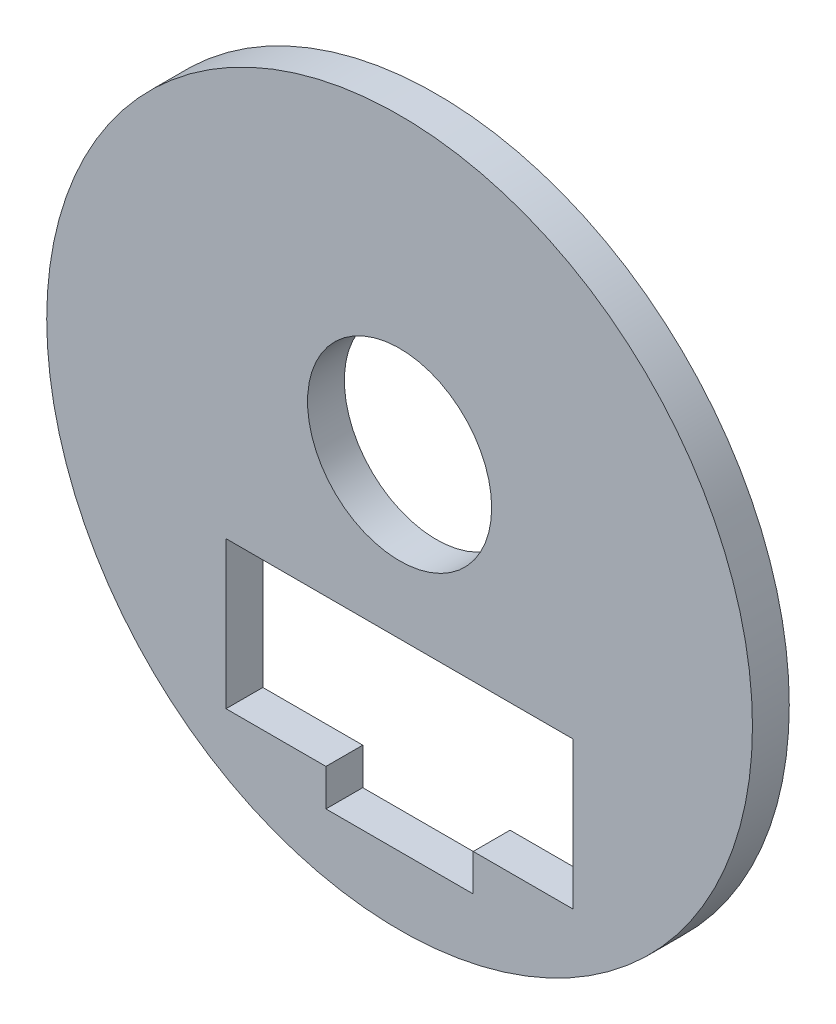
from build123d import *

# Parameters (mm, degrees)
SKETCH1_R           = 36.5125
EXTRUDE1_DEPTH      = 3.81
SKETCH2_R           = 9.525
CUT_EXTRUDE1_DEPTH  = 52.776842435
SKETCH3_W           = 35.9156
SKETCH3_H           = 15.24
CUT_EXTRUDE10_DEPTH = 52.776842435
SKETCH4_W           = 15.24
SKETCH4_H           = 3.81
CUT_EXTRUDE11_DEPTH = 52.776842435


with BuildPart() as part:
    # Sketch1 → Extrude1 (new body)
    with BuildSketch(Plane.XY):
        Circle(SKETCH1_R)
    extrude(amount=-EXTRUDE1_DEPTH)

    # Sketch2 → Cut-Extrude1 (cut, through all)
    with BuildSketch(Plane.XY):
        with Locations((0, 6.096)):
            Circle(SKETCH2_R)
    extrude(amount=-CUT_EXTRUDE1_DEPTH, mode=Mode.SUBTRACT)

    # Sketch3 → Cut-Extrude10 (cut, through all)
    with BuildSketch(Plane.XY):
        with Locations((0, -18.034)):
            Rectangle(SKETCH3_W, SKETCH3_H)
    extrude(amount=-CUT_EXTRUDE10_DEPTH, mode=Mode.SUBTRACT)

    # Sketch4 → Cut-Extrude11 (cut, through all)
    with BuildSketch(Plane(origin=(0, 0, -3.81), x_dir=(-1, 0, 0), z_dir=(0, 0, -1))):
        with Locations((0, -27.559)):
            Rectangle(SKETCH4_W, SKETCH4_H)
    extrude(amount=-CUT_EXTRUDE11_DEPTH, mode=Mode.SUBTRACT)


solid = part.part
